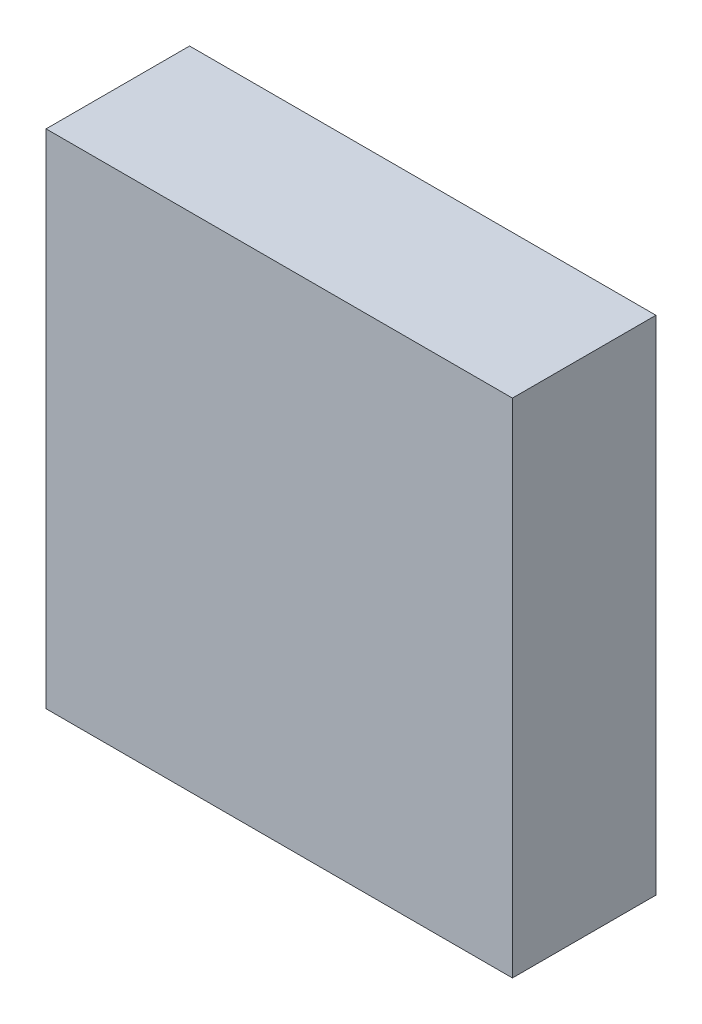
ISO-10303-21;
HEADER;
FILE_DESCRIPTION(('STEP AP214'),'2;1');
FILE_NAME('part.step','',(''),(''),'','','');
FILE_SCHEMA(('AUTOMOTIVE_DESIGN { 1 0 10303 214 1 1 1 1 }'));
ENDSEC;
DATA;
#1=APPLICATION_CONTEXT('core data for automotive mechanical design processes');
#2=APPLICATION_PROTOCOL_DEFINITION('international standard','automotive_design',2000,#1);
#3=PRODUCT_CONTEXT('',#1,'mechanical');
#4=PRODUCT('Part','Part','',(#3));
#5=PRODUCT_RELATED_PRODUCT_CATEGORY('part','',(#4));
#6=PRODUCT_DEFINITION_FORMATION('','',#4);
#7=PRODUCT_DEFINITION_CONTEXT('part definition',#1,'design');
#8=PRODUCT_DEFINITION('design','',#6,#7);
#9=PRODUCT_DEFINITION_SHAPE('','',#8);
#10=(LENGTH_UNIT() NAMED_UNIT(*) SI_UNIT(.MILLI.,.METRE.));
#11=(NAMED_UNIT(*) PLANE_ANGLE_UNIT() SI_UNIT($,.RADIAN.));
#12=(NAMED_UNIT(*) SI_UNIT($,.STERADIAN.) SOLID_ANGLE_UNIT());
#13=UNCERTAINTY_MEASURE_WITH_UNIT(LENGTH_MEASURE(1.E-05),#10,'distance_accuracy_value','');
#14=(GEOMETRIC_REPRESENTATION_CONTEXT(3) GLOBAL_UNCERTAINTY_ASSIGNED_CONTEXT((#13)) GLOBAL_UNIT_ASSIGNED_CONTEXT((#10,
#11,#12)) REPRESENTATION_CONTEXT('',''));
#15=CARTESIAN_POINT('',(0.,0.,0.));
#16=DIRECTION('',(0.,0.,1.));
#17=DIRECTION('',(1.,0.,0.));
#18=AXIS2_PLACEMENT_3D('',#15,#16,#17);
#19=CARTESIAN_POINT('',(0.,0.,20.));
#20=DIRECTION('',(1.,0.,0.));
#21=DIRECTION('',(0.,0.,-1.));
#22=AXIS2_PLACEMENT_3D('',#19,#20,#21);
#23=PLANE('',#22);
#24=DIRECTION('',(0.,-1.,0.));
#25=VECTOR('',#24,1.);
#26=CARTESIAN_POINT('',(0.,0.,0.));
#27=LINE('',#26,#25);
#28=CARTESIAN_POINT('',(0.,70.,0.));
#29=VERTEX_POINT('',#28);
#30=CARTESIAN_POINT('',(0.,0.,0.));
#31=VERTEX_POINT('',#30);
#32=EDGE_CURVE('E73',#29,#31,#27,.T.);
#33=ORIENTED_EDGE('',*,*,#32,.T.);
#34=DIRECTION('',(0.,0.,-1.));
#35=VECTOR('',#34,1.);
#36=CARTESIAN_POINT('',(0.,0.,20.));
#37=LINE('',#36,#35);
#38=CARTESIAN_POINT('',(0.,0.,20.));
#39=VERTEX_POINT('',#38);
#40=EDGE_CURVE('E11',#39,#31,#37,.T.);
#41=ORIENTED_EDGE('',*,*,#40,.F.);
#42=DIRECTION('',(0.,-1.,0.));
#43=VECTOR('',#42,1.);
#44=CARTESIAN_POINT('',(0.,0.,20.));
#45=LINE('',#44,#43);
#46=CARTESIAN_POINT('',(0.,70.,20.));
#47=VERTEX_POINT('',#46);
#48=EDGE_CURVE('E91',#47,#39,#45,.T.);
#49=ORIENTED_EDGE('',*,*,#48,.F.);
#50=DIRECTION('',(0.,0.,-1.));
#51=VECTOR('',#50,1.);
#52=CARTESIAN_POINT('',(0.,70.,20.));
#53=LINE('',#52,#51);
#54=EDGE_CURVE('E85',#47,#29,#53,.T.);
#55=ORIENTED_EDGE('',*,*,#54,.T.);
#56=EDGE_LOOP('',(#33,#41,#49,#55));
#57=FACE_BOUND('',#56,.T.);
#58=ADVANCED_FACE('F29',(#57),#23,.F.);
#59=CARTESIAN_POINT('',(0.,0.,20.));
#60=DIRECTION('',(0.,1.,0.));
#61=DIRECTION('',(0.,0.,1.));
#62=AXIS2_PLACEMENT_3D('',#59,#60,#61);
#63=PLANE('',#62);
#64=DIRECTION('',(1.,0.,0.));
#65=VECTOR('',#64,1.);
#66=CARTESIAN_POINT('',(0.,0.,0.));
#67=LINE('',#66,#65);
#68=CARTESIAN_POINT('',(65.,0.,0.));
#69=VERTEX_POINT('',#68);
#70=EDGE_CURVE('E69',#31,#69,#67,.T.);
#71=ORIENTED_EDGE('',*,*,#70,.T.);
#72=DIRECTION('',(0.,0.,-1.));
#73=VECTOR('',#72,1.);
#74=CARTESIAN_POINT('',(65.,0.,20.));
#75=LINE('',#74,#73);
#76=CARTESIAN_POINT('',(65.,0.,20.));
#77=VERTEX_POINT('',#76);
#78=EDGE_CURVE('E36',#77,#69,#75,.T.);
#79=ORIENTED_EDGE('',*,*,#78,.F.);
#80=DIRECTION('',(1.,0.,0.));
#81=VECTOR('',#80,1.);
#82=CARTESIAN_POINT('',(0.,0.,20.));
#83=LINE('',#82,#81);
#84=EDGE_CURVE('E81',#39,#77,#83,.T.);
#85=ORIENTED_EDGE('',*,*,#84,.F.);
#86=ORIENTED_EDGE('',*,*,#40,.T.);
#87=EDGE_LOOP('',(#71,#79,#85,#86));
#88=FACE_BOUND('',#87,.T.);
#89=ADVANCED_FACE('F80',(#88),#63,.F.);
#90=CARTESIAN_POINT('',(65.,0.,20.));
#91=DIRECTION('',(-1.,0.,0.));
#92=DIRECTION('',(0.,0.,1.));
#93=AXIS2_PLACEMENT_3D('',#90,#91,#92);
#94=PLANE('',#93);
#95=DIRECTION('',(0.,1.,0.));
#96=VECTOR('',#95,1.);
#97=CARTESIAN_POINT('',(65.,0.,0.));
#98=LINE('',#97,#96);
#99=CARTESIAN_POINT('',(65.,70.,0.));
#100=VERTEX_POINT('',#99);
#101=EDGE_CURVE('E74',#69,#100,#98,.T.);
#102=ORIENTED_EDGE('',*,*,#101,.T.);
#103=DIRECTION('',(0.,0.,-1.));
#104=VECTOR('',#103,1.);
#105=CARTESIAN_POINT('',(65.,70.,20.));
#106=LINE('',#105,#104);
#107=CARTESIAN_POINT('',(65.,70.,20.));
#108=VERTEX_POINT('',#107);
#109=EDGE_CURVE('E97',#108,#100,#106,.T.);
#110=ORIENTED_EDGE('',*,*,#109,.F.);
#111=DIRECTION('',(0.,1.,0.));
#112=VECTOR('',#111,1.);
#113=CARTESIAN_POINT('',(65.,0.,20.));
#114=LINE('',#113,#112);
#115=EDGE_CURVE('E48',#77,#108,#114,.T.);
#116=ORIENTED_EDGE('',*,*,#115,.F.);
#117=ORIENTED_EDGE('',*,*,#78,.T.);
#118=EDGE_LOOP('',(#102,#110,#116,#117));
#119=FACE_BOUND('',#118,.T.);
#120=ADVANCED_FACE('F100',(#119),#94,.F.);
#121=CARTESIAN_POINT('',(0.,70.,20.));
#122=DIRECTION('',(0.,-1.,0.));
#123=DIRECTION('',(0.,0.,-1.));
#124=AXIS2_PLACEMENT_3D('',#121,#122,#123);
#125=PLANE('',#124);
#126=DIRECTION('',(-1.,0.,0.));
#127=VECTOR('',#126,1.);
#128=CARTESIAN_POINT('',(0.,70.,0.));
#129=LINE('',#128,#127);
#130=EDGE_CURVE('E89',#100,#29,#129,.T.);
#131=ORIENTED_EDGE('',*,*,#130,.T.);
#132=ORIENTED_EDGE('',*,*,#54,.F.);
#133=DIRECTION('',(-1.,0.,0.));
#134=VECTOR('',#133,1.);
#135=CARTESIAN_POINT('',(0.,70.,20.));
#136=LINE('',#135,#134);
#137=EDGE_CURVE('E43',#108,#47,#136,.T.);
#138=ORIENTED_EDGE('',*,*,#137,.F.);
#139=ORIENTED_EDGE('',*,*,#109,.T.);
#140=EDGE_LOOP('',(#131,#132,#138,#139));
#141=FACE_BOUND('',#140,.T.);
#142=ADVANCED_FACE('F102',(#141),#125,.F.);
#143=CARTESIAN_POINT('',(0.,70.,20.));
#144=DIRECTION('',(0.,0.,-1.));
#145=DIRECTION('',(-1.,0.,0.));
#146=AXIS2_PLACEMENT_3D('',#143,#144,#145);
#147=PLANE('',#146);
#148=ORIENTED_EDGE('',*,*,#48,.T.);
#149=ORIENTED_EDGE('',*,*,#84,.T.);
#150=ORIENTED_EDGE('',*,*,#115,.T.);
#151=ORIENTED_EDGE('',*,*,#137,.T.);
#152=EDGE_LOOP('',(#148,#149,#150,#151));
#153=FACE_BOUND('',#152,.T.);
#154=ADVANCED_FACE('F103',(#153),#147,.F.);
#155=CARTESIAN_POINT('',(0.,70.,0.));
#156=DIRECTION('',(0.,0.,-1.));
#157=DIRECTION('',(-1.,0.,0.));
#158=AXIS2_PLACEMENT_3D('',#155,#156,#157);
#159=PLANE('',#158);
#160=ORIENTED_EDGE('',*,*,#32,.F.);
#161=ORIENTED_EDGE('',*,*,#130,.F.);
#162=ORIENTED_EDGE('',*,*,#101,.F.);
#163=ORIENTED_EDGE('',*,*,#70,.F.);
#164=EDGE_LOOP('',(#160,#161,#162,#163));
#165=FACE_BOUND('',#164,.T.);
#166=ADVANCED_FACE('F70',(#165),#159,.T.);
#167=CLOSED_SHELL('',(#58,#89,#120,#142,#154,#166));
#168=MANIFOLD_SOLID_BREP('B2',#167);
#169=ADVANCED_BREP_SHAPE_REPRESENTATION('',(#18,#168),#14);
#170=SHAPE_DEFINITION_REPRESENTATION(#9,#169);
ENDSEC;
END-ISO-10303-21;
